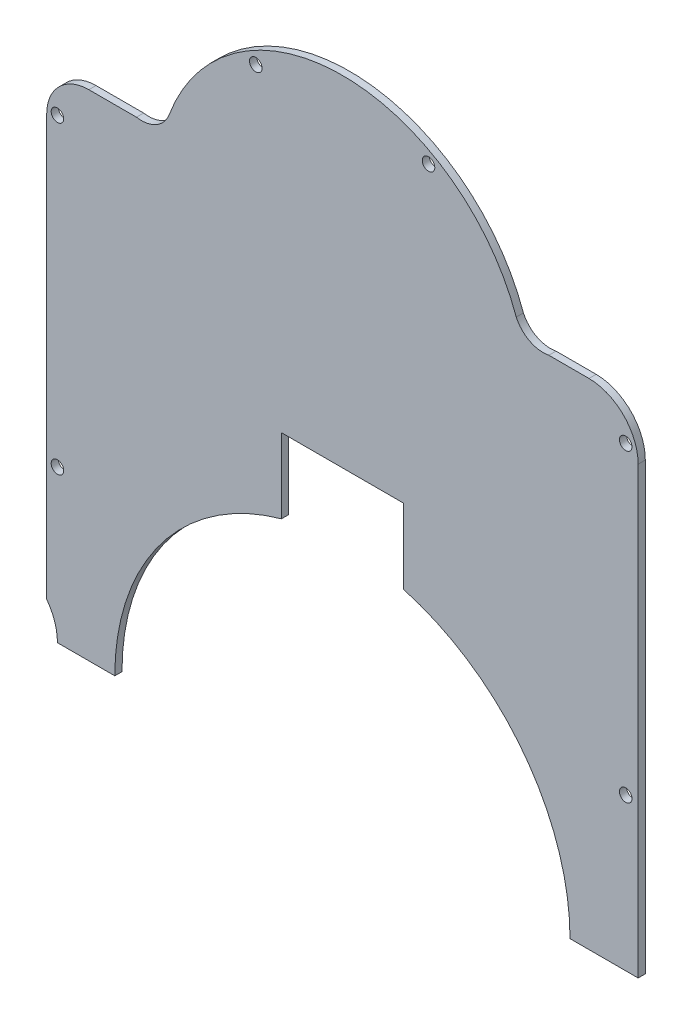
ISO-10303-21;
HEADER;
FILE_DESCRIPTION(('STEP AP214'),'2;1');
FILE_NAME('part.step','',(''),(''),'','','');
FILE_SCHEMA(('AUTOMOTIVE_DESIGN { 1 0 10303 214 1 1 1 1 }'));
ENDSEC;
DATA;
#1=APPLICATION_CONTEXT('core data for automotive mechanical design processes');
#2=APPLICATION_PROTOCOL_DEFINITION('international standard','automotive_design',2000,#1);
#3=PRODUCT_CONTEXT('',#1,'mechanical');
#4=PRODUCT('Part','Part','',(#3));
#5=PRODUCT_RELATED_PRODUCT_CATEGORY('part','',(#4));
#6=PRODUCT_DEFINITION_FORMATION('','',#4);
#7=PRODUCT_DEFINITION_CONTEXT('part definition',#1,'design');
#8=PRODUCT_DEFINITION('design','',#6,#7);
#9=PRODUCT_DEFINITION_SHAPE('','',#8);
#10=(LENGTH_UNIT() NAMED_UNIT(*) SI_UNIT(.MILLI.,.METRE.));
#11=(NAMED_UNIT(*) PLANE_ANGLE_UNIT() SI_UNIT($,.RADIAN.));
#12=(NAMED_UNIT(*) SI_UNIT($,.STERADIAN.) SOLID_ANGLE_UNIT());
#13=UNCERTAINTY_MEASURE_WITH_UNIT(LENGTH_MEASURE(1.E-05),#10,'distance_accuracy_value','');
#14=(GEOMETRIC_REPRESENTATION_CONTEXT(3) GLOBAL_UNCERTAINTY_ASSIGNED_CONTEXT((#13)) GLOBAL_UNIT_ASSIGNED_CONTEXT((#10,
#11,#12)) REPRESENTATION_CONTEXT('',''));
#15=CARTESIAN_POINT('',(0.,0.,0.));
#16=DIRECTION('',(0.,0.,1.));
#17=DIRECTION('',(1.,0.,0.));
#18=AXIS2_PLACEMENT_3D('',#15,#16,#17);
#19=CARTESIAN_POINT('',(0.,37.1227716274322,2.));
#20=DIRECTION('',(0.,0.,-1.));
#21=DIRECTION('',(-1.,0.,0.));
#22=AXIS2_PLACEMENT_3D('',#19,#20,#21);
#23=CYLINDRICAL_SURFACE('',#22,51.5077312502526);
#24=CARTESIAN_POINT('',(0.,37.1227716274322,0.));
#25=DIRECTION('',(0.,0.,1.));
#26=DIRECTION('',(1.,0.,0.));
#27=AXIS2_PLACEMENT_3D('',#24,#25,#26);
#28=CIRCLE('',#27,51.5077312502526);
#29=CARTESIAN_POINT('',(48.4961716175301,54.4769560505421,0.));
#30=VERTEX_POINT('',#29);
#31=CARTESIAN_POINT('',(-48.3027385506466,55.0082916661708,0.));
#32=VERTEX_POINT('',#31);
#33=EDGE_CURVE('E155',#30,#32,#28,.T.);
#34=ORIENTED_EDGE('',*,*,#33,.T.);
#35=DIRECTION('',(0.,0.,-1.));
#36=VECTOR('',#35,1.);
#37=CARTESIAN_POINT('',(-48.3027385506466,55.0082916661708,2.));
#38=LINE('',#37,#36);
#39=CARTESIAN_POINT('',(-48.3027385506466,55.0082916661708,2.));
#40=VERTEX_POINT('',#39);
#41=EDGE_CURVE('E11',#40,#32,#38,.T.);
#42=ORIENTED_EDGE('',*,*,#41,.F.);
#43=CARTESIAN_POINT('',(0.,37.1227716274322,2.));
#44=DIRECTION('',(0.,0.,1.));
#45=DIRECTION('',(1.,0.,0.));
#46=AXIS2_PLACEMENT_3D('',#43,#44,#45);
#47=CIRCLE('',#46,51.5077312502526);
#48=CARTESIAN_POINT('',(48.4961716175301,54.4769560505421,2.));
#49=VERTEX_POINT('',#48);
#50=EDGE_CURVE('E205',#49,#40,#47,.T.);
#51=ORIENTED_EDGE('',*,*,#50,.F.);
#52=DIRECTION('',(0.,0.,-1.));
#53=VECTOR('',#52,1.);
#54=CARTESIAN_POINT('',(48.4961716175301,54.4769560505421,2.));
#55=LINE('',#54,#53);
#56=EDGE_CURVE('E168',#49,#30,#55,.T.);
#57=ORIENTED_EDGE('',*,*,#56,.T.);
#58=EDGE_LOOP('',(#34,#42,#51,#57));
#59=FACE_BOUND('',#58,.T.);
#60=ADVANCED_FACE('F33',(#59),#23,.T.);
#61=CARTESIAN_POINT('',(-56.021869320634,57.9072576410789,2.));
#62=DIRECTION('',(0.,0.,-1.));
#63=DIRECTION('',(-1.,0.,0.));
#64=AXIS2_PLACEMENT_3D('',#61,#62,#63);
#65=CYLINDRICAL_SURFACE('',#64,8.24554325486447);
#66=CARTESIAN_POINT('',(-56.021869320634,57.9072576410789,0.));
#67=DIRECTION('',(0.,0.,-1.));
#68=DIRECTION('',(1.,0.,0.));
#69=AXIS2_PLACEMENT_3D('',#66,#67,#68);
#70=CIRCLE('',#69,8.24554325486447);
#71=CARTESIAN_POINT('',(-57.4466473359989,49.7857435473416,0.));
#72=VERTEX_POINT('',#71);
#73=EDGE_CURVE('E151',#32,#72,#70,.T.);
#74=ORIENTED_EDGE('',*,*,#73,.T.);
#75=DIRECTION('',(0.,0.,-1.));
#76=VECTOR('',#75,1.);
#77=CARTESIAN_POINT('',(-57.4466473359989,49.7857435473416,2.));
#78=LINE('',#77,#76);
#79=CARTESIAN_POINT('',(-57.4466473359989,49.7857435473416,2.));
#80=VERTEX_POINT('',#79);
#81=EDGE_CURVE('E40',#80,#72,#78,.T.);
#82=ORIENTED_EDGE('',*,*,#81,.F.);
#83=CARTESIAN_POINT('',(-56.021869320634,57.9072576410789,2.));
#84=DIRECTION('',(0.,0.,-1.));
#85=DIRECTION('',(1.,0.,0.));
#86=AXIS2_PLACEMENT_3D('',#83,#84,#85);
#87=CIRCLE('',#86,8.24554325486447);
#88=EDGE_CURVE('E164',#40,#80,#87,.T.);
#89=ORIENTED_EDGE('',*,*,#88,.F.);
#90=ORIENTED_EDGE('',*,*,#41,.T.);
#91=EDGE_LOOP('',(#74,#82,#89,#90));
#92=FACE_BOUND('',#91,.T.);
#93=ADVANCED_FACE('F163',(#92),#65,.F.);
#94=CARTESIAN_POINT('',(-57.4466473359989,49.7857435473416,2.));
#95=DIRECTION('',(0.,-1.,0.));
#96=DIRECTION('',(0.,0.,-1.));
#97=AXIS2_PLACEMENT_3D('',#94,#95,#96);
#98=PLANE('',#97);
#99=DIRECTION('',(-1.,0.,0.));
#100=VECTOR('',#99,1.);
#101=CARTESIAN_POINT('',(-57.4466473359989,49.7857435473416,0.));
#102=LINE('',#101,#100);
#103=CARTESIAN_POINT('',(-70.7455432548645,49.7857435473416,0.));
#104=VERTEX_POINT('',#103);
#105=EDGE_CURVE('E157',#72,#104,#102,.T.);
#106=ORIENTED_EDGE('',*,*,#105,.T.);
#107=DIRECTION('',(0.,0.,-1.));
#108=VECTOR('',#107,1.);
#109=CARTESIAN_POINT('',(-70.7455432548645,49.7857435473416,2.));
#110=LINE('',#109,#108);
#111=CARTESIAN_POINT('',(-70.7455432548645,49.7857435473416,2.));
#112=VERTEX_POINT('',#111);
#113=EDGE_CURVE('E276',#112,#104,#110,.T.);
#114=ORIENTED_EDGE('',*,*,#113,.F.);
#115=DIRECTION('',(-1.,0.,0.));
#116=VECTOR('',#115,1.);
#117=CARTESIAN_POINT('',(-57.4466473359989,49.7857435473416,2.));
#118=LINE('',#117,#116);
#119=EDGE_CURVE('E208',#80,#112,#118,.T.);
#120=ORIENTED_EDGE('',*,*,#119,.F.);
#121=ORIENTED_EDGE('',*,*,#81,.T.);
#122=EDGE_LOOP('',(#106,#114,#120,#121));
#123=FACE_BOUND('',#122,.T.);
#124=ADVANCED_FACE('F280',(#123),#98,.F.);
#125=CARTESIAN_POINT('',(-70.7455432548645,38.0312868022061,2.));
#126=DIRECTION('',(0.,0.,-1.));
#127=DIRECTION('',(-1.,0.,0.));
#128=AXIS2_PLACEMENT_3D('',#125,#126,#127);
#129=CYLINDRICAL_SURFACE('',#128,11.7544567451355);
#130=CARTESIAN_POINT('',(-70.7455432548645,38.0312868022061,0.));
#131=DIRECTION('',(0.,0.,1.));
#132=DIRECTION('',(1.,0.,0.));
#133=AXIS2_PLACEMENT_3D('',#130,#131,#132);
#134=CIRCLE('',#133,11.7544567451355);
#135=CARTESIAN_POINT('',(-82.5,38.0312868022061,0.));
#136=VERTEX_POINT('',#135);
#137=EDGE_CURVE('E177',#104,#136,#134,.T.);
#138=ORIENTED_EDGE('',*,*,#137,.T.);
#139=DIRECTION('',(0.,0.,-1.));
#140=VECTOR('',#139,1.);
#141=CARTESIAN_POINT('',(-82.5,38.0312868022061,2.));
#142=LINE('',#141,#140);
#143=CARTESIAN_POINT('',(-82.5,38.0312868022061,2.));
#144=VERTEX_POINT('',#143);
#145=EDGE_CURVE('E273',#144,#136,#142,.T.);
#146=ORIENTED_EDGE('',*,*,#145,.F.);
#147=CARTESIAN_POINT('',(-70.7455432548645,38.0312868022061,2.));
#148=DIRECTION('',(0.,0.,1.));
#149=DIRECTION('',(1.,0.,0.));
#150=AXIS2_PLACEMENT_3D('',#147,#148,#149);
#151=CIRCLE('',#150,11.7544567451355);
#152=EDGE_CURVE('E210',#112,#144,#151,.T.);
#153=ORIENTED_EDGE('',*,*,#152,.F.);
#154=ORIENTED_EDGE('',*,*,#113,.T.);
#155=EDGE_LOOP('',(#138,#146,#153,#154));
#156=FACE_BOUND('',#155,.T.);
#157=ADVANCED_FACE('F288',(#156),#129,.T.);
#158=CARTESIAN_POINT('',(-82.5,38.0312868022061,2.));
#159=DIRECTION('',(1.,0.,0.));
#160=DIRECTION('',(0.,1.,0.));
#161=AXIS2_PLACEMENT_3D('',#158,#159,#160);
#162=PLANE('',#161);
#163=DIRECTION('',(0.,-1.,0.));
#164=VECTOR('',#163,1.);
#165=CARTESIAN_POINT('',(-82.5,38.0312868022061,0.));
#166=LINE('',#165,#164);
#167=CARTESIAN_POINT('',(-82.5,-79.2142564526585,0.));
#168=VERTEX_POINT('',#167);
#169=EDGE_CURVE('E179',#136,#168,#166,.T.);
#170=ORIENTED_EDGE('',*,*,#169,.T.);
#171=DIRECTION('',(0.,0.,-1.));
#172=VECTOR('',#171,1.);
#173=CARTESIAN_POINT('',(-82.5,-79.2142564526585,2.));
#174=LINE('',#173,#172);
#175=CARTESIAN_POINT('',(-82.5,-79.2142564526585,2.));
#176=VERTEX_POINT('',#175);
#177=EDGE_CURVE('E270',#176,#168,#174,.T.);
#178=ORIENTED_EDGE('',*,*,#177,.F.);
#179=DIRECTION('',(0.,-1.,0.));
#180=VECTOR('',#179,1.);
#181=CARTESIAN_POINT('',(-82.5,38.0312868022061,2.));
#182=LINE('',#181,#180);
#183=EDGE_CURVE('E212',#144,#176,#182,.T.);
#184=ORIENTED_EDGE('',*,*,#183,.F.);
#185=ORIENTED_EDGE('',*,*,#145,.T.);
#186=EDGE_LOOP('',(#170,#178,#184,#185));
#187=FACE_BOUND('',#186,.T.);
#188=ADVANCED_FACE('F291',(#187),#162,.F.);
#189=CARTESIAN_POINT('',(-94.5,-88.2142564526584,2.));
#190=DIRECTION('',(0.,0.,-1.));
#191=DIRECTION('',(-1.,0.,0.));
#192=AXIS2_PLACEMENT_3D('',#189,#190,#191);
#193=CYLINDRICAL_SURFACE('',#192,15.);
#194=CARTESIAN_POINT('',(-94.5,-88.2142564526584,0.));
#195=DIRECTION('',(0.,0.,-1.));
#196=DIRECTION('',(1.,0.,0.));
#197=AXIS2_PLACEMENT_3D('',#194,#195,#196);
#198=CIRCLE('',#197,15.);
#199=CARTESIAN_POINT('',(-79.5,-88.2142564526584,0.));
#200=VERTEX_POINT('',#199);
#201=EDGE_CURVE('E181',#168,#200,#198,.T.);
#202=ORIENTED_EDGE('',*,*,#201,.T.);
#203=DIRECTION('',(0.,0.,-1.));
#204=VECTOR('',#203,1.);
#205=CARTESIAN_POINT('',(-79.5,-88.2142564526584,2.));
#206=LINE('',#205,#204);
#207=CARTESIAN_POINT('',(-79.5,-88.2142564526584,2.));
#208=VERTEX_POINT('',#207);
#209=EDGE_CURVE('E267',#208,#200,#206,.T.);
#210=ORIENTED_EDGE('',*,*,#209,.F.);
#211=CARTESIAN_POINT('',(-94.5,-88.2142564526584,2.));
#212=DIRECTION('',(0.,0.,-1.));
#213=DIRECTION('',(1.,0.,0.));
#214=AXIS2_PLACEMENT_3D('',#211,#212,#213);
#215=CIRCLE('',#214,15.);
#216=EDGE_CURVE('E214',#176,#208,#215,.T.);
#217=ORIENTED_EDGE('',*,*,#216,.F.);
#218=ORIENTED_EDGE('',*,*,#177,.T.);
#219=EDGE_LOOP('',(#202,#210,#217,#218));
#220=FACE_BOUND('',#219,.T.);
#221=ADVANCED_FACE('F296',(#220),#193,.F.);
#222=CARTESIAN_POINT('',(-79.5,-88.2142564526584,2.));
#223=DIRECTION('',(0.,1.,0.));
#224=DIRECTION('',(-1.,0.,0.));
#225=AXIS2_PLACEMENT_3D('',#222,#223,#224);
#226=PLANE('',#225);
#227=DIRECTION('',(1.,0.,0.));
#228=VECTOR('',#227,1.);
#229=CARTESIAN_POINT('',(-79.5,-88.2142564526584,0.));
#230=LINE('',#229,#228);
#231=CARTESIAN_POINT('',(-63.5,-88.2142564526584,0.));
#232=VERTEX_POINT('',#231);
#233=EDGE_CURVE('E183',#200,#232,#230,.T.);
#234=ORIENTED_EDGE('',*,*,#233,.T.);
#235=DIRECTION('',(0.,0.,-1.));
#236=VECTOR('',#235,1.);
#237=CARTESIAN_POINT('',(-63.5,-88.2142564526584,2.));
#238=LINE('',#237,#236);
#239=CARTESIAN_POINT('',(-63.5,-88.2142564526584,2.));
#240=VERTEX_POINT('',#239);
#241=EDGE_CURVE('E264',#240,#232,#238,.T.);
#242=ORIENTED_EDGE('',*,*,#241,.F.);
#243=DIRECTION('',(1.,0.,0.));
#244=VECTOR('',#243,1.);
#245=CARTESIAN_POINT('',(-79.5,-88.2142564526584,2.));
#246=LINE('',#245,#244);
#247=EDGE_CURVE('E216',#208,#240,#246,.T.);
#248=ORIENTED_EDGE('',*,*,#247,.F.);
#249=ORIENTED_EDGE('',*,*,#209,.T.);
#250=EDGE_LOOP('',(#234,#242,#248,#249));
#251=FACE_BOUND('',#250,.T.);
#252=ADVANCED_FACE('F302',(#251),#226,.F.);
#253=CARTESIAN_POINT('',(0.,-88.2142564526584,2.));
#254=DIRECTION('',(0.,0.,-1.));
#255=DIRECTION('',(-1.,0.,0.));
#256=AXIS2_PLACEMENT_3D('',#253,#254,#255);
#257=CYLINDRICAL_SURFACE('',#256,63.5);
#258=CARTESIAN_POINT('',(0.,-88.2142564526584,0.));
#259=DIRECTION('',(0.,0.,-1.));
#260=DIRECTION('',(-1.,0.,0.));
#261=AXIS2_PLACEMENT_3D('',#258,#259,#260);
#262=CIRCLE('',#261,63.5);
#263=CARTESIAN_POINT('',(-17.,-27.0321512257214,0.));
#264=VERTEX_POINT('',#263);
#265=EDGE_CURVE('E185',#232,#264,#262,.T.);
#266=ORIENTED_EDGE('',*,*,#265,.T.);
#267=DIRECTION('',(0.,0.,-1.));
#268=VECTOR('',#267,1.);
#269=CARTESIAN_POINT('',(-17.,-27.0321512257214,2.));
#270=LINE('',#269,#268);
#271=CARTESIAN_POINT('',(-17.,-27.0321512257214,2.));
#272=VERTEX_POINT('',#271);
#273=EDGE_CURVE('E261',#272,#264,#270,.T.);
#274=ORIENTED_EDGE('',*,*,#273,.F.);
#275=CARTESIAN_POINT('',(0.,-88.2142564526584,2.));
#276=DIRECTION('',(0.,0.,-1.));
#277=DIRECTION('',(-1.,0.,0.));
#278=AXIS2_PLACEMENT_3D('',#275,#276,#277);
#279=CIRCLE('',#278,63.5);
#280=EDGE_CURVE('E218',#240,#272,#279,.T.);
#281=ORIENTED_EDGE('',*,*,#280,.F.);
#282=ORIENTED_EDGE('',*,*,#241,.T.);
#283=EDGE_LOOP('',(#266,#274,#281,#282));
#284=FACE_BOUND('',#283,.T.);
#285=ADVANCED_FACE('F306',(#284),#257,.F.);
#286=CARTESIAN_POINT('',(-17.,-27.0321512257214,2.));
#287=DIRECTION('',(-1.,0.,0.));
#288=DIRECTION('',(0.,0.,1.));
#289=AXIS2_PLACEMENT_3D('',#286,#287,#288);
#290=PLANE('',#289);
#291=DIRECTION('',(0.,1.,0.));
#292=VECTOR('',#291,1.);
#293=CARTESIAN_POINT('',(-17.,-27.0321512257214,0.));
#294=LINE('',#293,#292);
#295=CARTESIAN_POINT('',(-17.,-6.21425645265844,0.));
#296=VERTEX_POINT('',#295);
#297=EDGE_CURVE('E187',#264,#296,#294,.T.);
#298=ORIENTED_EDGE('',*,*,#297,.T.);
#299=DIRECTION('',(0.,0.,-1.));
#300=VECTOR('',#299,1.);
#301=CARTESIAN_POINT('',(-17.,-6.21425645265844,2.));
#302=LINE('',#301,#300);
#303=CARTESIAN_POINT('',(-17.,-6.21425645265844,2.));
#304=VERTEX_POINT('',#303);
#305=EDGE_CURVE('E258',#304,#296,#302,.T.);
#306=ORIENTED_EDGE('',*,*,#305,.F.);
#307=DIRECTION('',(0.,1.,0.));
#308=VECTOR('',#307,1.);
#309=CARTESIAN_POINT('',(-17.,-27.0321512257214,2.));
#310=LINE('',#309,#308);
#311=EDGE_CURVE('E220',#272,#304,#310,.T.);
#312=ORIENTED_EDGE('',*,*,#311,.F.);
#313=ORIENTED_EDGE('',*,*,#273,.T.);
#314=EDGE_LOOP('',(#298,#306,#312,#313));
#315=FACE_BOUND('',#314,.T.);
#316=ADVANCED_FACE('F311',(#315),#290,.F.);
#317=CARTESIAN_POINT('',(-17.,-6.21425645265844,2.));
#318=DIRECTION('',(0.,1.,0.));
#319=DIRECTION('',(0.,0.,1.));
#320=AXIS2_PLACEMENT_3D('',#317,#318,#319);
#321=PLANE('',#320);
#322=DIRECTION('',(1.,0.,0.));
#323=VECTOR('',#322,1.);
#324=CARTESIAN_POINT('',(-17.,-6.21425645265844,0.));
#325=LINE('',#324,#323);
#326=CARTESIAN_POINT('',(17.,-6.21425645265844,0.));
#327=VERTEX_POINT('',#326);
#328=EDGE_CURVE('E189',#296,#327,#325,.T.);
#329=ORIENTED_EDGE('',*,*,#328,.T.);
#330=DIRECTION('',(0.,0.,-1.));
#331=VECTOR('',#330,1.);
#332=CARTESIAN_POINT('',(17.,-6.21425645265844,2.));
#333=LINE('',#332,#331);
#334=CARTESIAN_POINT('',(17.,-6.21425645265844,2.));
#335=VERTEX_POINT('',#334);
#336=EDGE_CURVE('E255',#335,#327,#333,.T.);
#337=ORIENTED_EDGE('',*,*,#336,.F.);
#338=DIRECTION('',(1.,0.,0.));
#339=VECTOR('',#338,1.);
#340=CARTESIAN_POINT('',(-17.,-6.21425645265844,2.));
#341=LINE('',#340,#339);
#342=EDGE_CURVE('E222',#304,#335,#341,.T.);
#343=ORIENTED_EDGE('',*,*,#342,.F.);
#344=ORIENTED_EDGE('',*,*,#305,.T.);
#345=EDGE_LOOP('',(#329,#337,#343,#344));
#346=FACE_BOUND('',#345,.T.);
#347=ADVANCED_FACE('F317',(#346),#321,.F.);
#348=CARTESIAN_POINT('',(17.,-6.21425645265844,2.));
#349=DIRECTION('',(1.,0.,0.));
#350=DIRECTION('',(0.,1.,0.));
#351=AXIS2_PLACEMENT_3D('',#348,#349,#350);
#352=PLANE('',#351);
#353=DIRECTION('',(0.,-1.,0.));
#354=VECTOR('',#353,1.);
#355=CARTESIAN_POINT('',(17.,-6.21425645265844,0.));
#356=LINE('',#355,#354);
#357=CARTESIAN_POINT('',(17.,-27.0321512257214,0.));
#358=VERTEX_POINT('',#357);
#359=EDGE_CURVE('E191',#327,#358,#356,.T.);
#360=ORIENTED_EDGE('',*,*,#359,.T.);
#361=DIRECTION('',(0.,0.,-1.));
#362=VECTOR('',#361,1.);
#363=CARTESIAN_POINT('',(17.,-27.0321512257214,2.));
#364=LINE('',#363,#362);
#365=CARTESIAN_POINT('',(17.,-27.0321512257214,2.));
#366=VERTEX_POINT('',#365);
#367=EDGE_CURVE('E252',#366,#358,#364,.T.);
#368=ORIENTED_EDGE('',*,*,#367,.F.);
#369=DIRECTION('',(0.,-1.,0.));
#370=VECTOR('',#369,1.);
#371=CARTESIAN_POINT('',(17.,-6.21425645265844,2.));
#372=LINE('',#371,#370);
#373=EDGE_CURVE('E224',#335,#366,#372,.T.);
#374=ORIENTED_EDGE('',*,*,#373,.F.);
#375=ORIENTED_EDGE('',*,*,#336,.T.);
#376=EDGE_LOOP('',(#360,#368,#374,#375));
#377=FACE_BOUND('',#376,.T.);
#378=ADVANCED_FACE('F321',(#377),#352,.F.);
#379=CARTESIAN_POINT('',(0.,-88.2142564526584,2.));
#380=DIRECTION('',(0.,0.,-1.));
#381=DIRECTION('',(-1.,0.,0.));
#382=AXIS2_PLACEMENT_3D('',#379,#380,#381);
#383=CYLINDRICAL_SURFACE('',#382,63.5);
#384=CARTESIAN_POINT('',(0.,-88.2142564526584,0.));
#385=DIRECTION('',(0.,0.,-1.));
#386=DIRECTION('',(-1.,0.,0.));
#387=AXIS2_PLACEMENT_3D('',#384,#385,#386);
#388=CIRCLE('',#387,63.5);
#389=CARTESIAN_POINT('',(63.5,-88.2142564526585,0.));
#390=VERTEX_POINT('',#389);
#391=EDGE_CURVE('E193',#358,#390,#388,.T.);
#392=ORIENTED_EDGE('',*,*,#391,.T.);
#393=DIRECTION('',(0.,0.,-1.));
#394=VECTOR('',#393,1.);
#395=CARTESIAN_POINT('',(63.5,-88.2142564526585,2.));
#396=LINE('',#395,#394);
#397=CARTESIAN_POINT('',(63.5,-88.2142564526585,2.));
#398=VERTEX_POINT('',#397);
#399=EDGE_CURVE('E249',#398,#390,#396,.T.);
#400=ORIENTED_EDGE('',*,*,#399,.F.);
#401=CARTESIAN_POINT('',(0.,-88.2142564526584,2.));
#402=DIRECTION('',(0.,0.,-1.));
#403=DIRECTION('',(-1.,0.,0.));
#404=AXIS2_PLACEMENT_3D('',#401,#402,#403);
#405=CIRCLE('',#404,63.5);
#406=EDGE_CURVE('E226',#366,#398,#405,.T.);
#407=ORIENTED_EDGE('',*,*,#406,.F.);
#408=ORIENTED_EDGE('',*,*,#367,.T.);
#409=EDGE_LOOP('',(#392,#400,#407,#408));
#410=FACE_BOUND('',#409,.T.);
#411=ADVANCED_FACE('F326',(#410),#383,.F.);
#412=CARTESIAN_POINT('',(82.5,-88.2142564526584,2.));
#413=DIRECTION('',(0.,1.,0.));
#414=DIRECTION('',(-1.,0.,0.));
#415=AXIS2_PLACEMENT_3D('',#412,#413,#414);
#416=PLANE('',#415);
#417=DIRECTION('',(1.,0.,0.));
#418=VECTOR('',#417,1.);
#419=CARTESIAN_POINT('',(82.5,-88.2142564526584,0.));
#420=LINE('',#419,#418);
#421=CARTESIAN_POINT('',(82.5,-88.2142564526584,0.));
#422=VERTEX_POINT('',#421);
#423=EDGE_CURVE('E195',#390,#422,#420,.T.);
#424=ORIENTED_EDGE('',*,*,#423,.T.);
#425=DIRECTION('',(0.,0.,-1.));
#426=VECTOR('',#425,1.);
#427=CARTESIAN_POINT('',(82.5,-88.2142564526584,2.));
#428=LINE('',#427,#426);
#429=CARTESIAN_POINT('',(82.5,-88.2142564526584,2.));
#430=VERTEX_POINT('',#429);
#431=EDGE_CURVE('E246',#430,#422,#428,.T.);
#432=ORIENTED_EDGE('',*,*,#431,.F.);
#433=DIRECTION('',(1.,0.,0.));
#434=VECTOR('',#433,1.);
#435=CARTESIAN_POINT('',(82.5,-88.2142564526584,2.));
#436=LINE('',#435,#434);
#437=EDGE_CURVE('E228',#398,#430,#436,.T.);
#438=ORIENTED_EDGE('',*,*,#437,.F.);
#439=ORIENTED_EDGE('',*,*,#399,.T.);
#440=EDGE_LOOP('',(#424,#432,#438,#439));
#441=FACE_BOUND('',#440,.T.);
#442=ADVANCED_FACE('F332',(#441),#416,.F.);
#443=CARTESIAN_POINT('',(82.5,-88.2142564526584,2.));
#444=DIRECTION('',(-1.,0.,0.));
#445=DIRECTION('',(0.,0.,1.));
#446=AXIS2_PLACEMENT_3D('',#443,#444,#445);
#447=PLANE('',#446);
#448=DIRECTION('',(0.,1.,0.));
#449=VECTOR('',#448,1.);
#450=CARTESIAN_POINT('',(82.5,-88.2142564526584,0.));
#451=LINE('',#450,#449);
#452=CARTESIAN_POINT('',(82.5,35.9208109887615,0.));
#453=VERTEX_POINT('',#452);
#454=EDGE_CURVE('E197',#422,#453,#451,.T.);
#455=ORIENTED_EDGE('',*,*,#454,.T.);
#456=DIRECTION('',(0.,0.,-1.));
#457=VECTOR('',#456,1.);
#458=CARTESIAN_POINT('',(82.5,35.9208109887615,2.));
#459=LINE('',#458,#457);
#460=CARTESIAN_POINT('',(82.5,35.9208109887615,2.));
#461=VERTEX_POINT('',#460);
#462=EDGE_CURVE('E243',#461,#453,#459,.T.);
#463=ORIENTED_EDGE('',*,*,#462,.F.);
#464=DIRECTION('',(0.,1.,0.));
#465=VECTOR('',#464,1.);
#466=CARTESIAN_POINT('',(82.5,-88.2142564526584,2.));
#467=LINE('',#466,#465);
#468=EDGE_CURVE('E230',#430,#461,#467,.T.);
#469=ORIENTED_EDGE('',*,*,#468,.F.);
#470=ORIENTED_EDGE('',*,*,#431,.T.);
#471=EDGE_LOOP('',(#455,#463,#469,#470));
#472=FACE_BOUND('',#471,.T.);
#473=ADVANCED_FACE('F336',(#472),#447,.F.);
#474=CARTESIAN_POINT('',(68.6342239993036,35.9208109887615,2.));
#475=DIRECTION('',(0.,0.,-1.));
#476=DIRECTION('',(-1.,0.,0.));
#477=AXIS2_PLACEMENT_3D('',#474,#475,#476);
#478=CYLINDRICAL_SURFACE('',#477,13.8657760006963);
#479=CARTESIAN_POINT('',(68.6342239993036,35.9208109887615,0.));
#480=DIRECTION('',(0.,0.,1.));
#481=DIRECTION('',(1.,0.,0.));
#482=AXIS2_PLACEMENT_3D('',#479,#480,#481);
#483=CIRCLE('',#482,13.8657760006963);
#484=CARTESIAN_POINT('',(68.7871594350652,49.7857435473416,0.));
#485=VERTEX_POINT('',#484);
#486=EDGE_CURVE('E199',#453,#485,#483,.T.);
#487=ORIENTED_EDGE('',*,*,#486,.T.);
#488=DIRECTION('',(0.,0.,-1.));
#489=VECTOR('',#488,1.);
#490=CARTESIAN_POINT('',(68.7871594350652,49.7857435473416,2.));
#491=LINE('',#490,#489);
#492=CARTESIAN_POINT('',(68.7871594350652,49.7857435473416,2.));
#493=VERTEX_POINT('',#492);
#494=EDGE_CURVE('E240',#493,#485,#491,.T.);
#495=ORIENTED_EDGE('',*,*,#494,.F.);
#496=CARTESIAN_POINT('',(68.6342239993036,35.9208109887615,2.));
#497=DIRECTION('',(0.,0.,1.));
#498=DIRECTION('',(1.,0.,0.));
#499=AXIS2_PLACEMENT_3D('',#496,#497,#498);
#500=CIRCLE('',#499,13.8657760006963);
#501=EDGE_CURVE('E232',#461,#493,#500,.T.);
#502=ORIENTED_EDGE('',*,*,#501,.F.);
#503=ORIENTED_EDGE('',*,*,#462,.T.);
#504=EDGE_LOOP('',(#487,#495,#502,#503));
#505=FACE_BOUND('',#504,.T.);
#506=ADVANCED_FACE('F341',(#505),#478,.T.);
#507=CARTESIAN_POINT('',(68.7871594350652,49.7857435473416,2.));
#508=DIRECTION('',(0.,-1.,0.));
#509=DIRECTION('',(0.,0.,-1.));
#510=AXIS2_PLACEMENT_3D('',#507,#508,#509);
#511=PLANE('',#510);
#512=DIRECTION('',(-1.,0.,0.));
#513=VECTOR('',#512,1.);
#514=CARTESIAN_POINT('',(68.7871594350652,49.7857435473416,0.));
#515=LINE('',#514,#513);
#516=CARTESIAN_POINT('',(57.5809147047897,49.7857435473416,0.));
#517=VERTEX_POINT('',#516);
#518=EDGE_CURVE('E201',#485,#517,#515,.T.);
#519=ORIENTED_EDGE('',*,*,#518,.T.);
#520=DIRECTION('',(0.,0.,-1.));
#521=VECTOR('',#520,1.);
#522=CARTESIAN_POINT('',(57.5809147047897,49.7857435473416,2.));
#523=LINE('',#522,#521);
#524=CARTESIAN_POINT('',(57.5809147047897,49.7857435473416,2.));
#525=VERTEX_POINT('',#524);
#526=EDGE_CURVE('E237',#525,#517,#523,.T.);
#527=ORIENTED_EDGE('',*,*,#526,.F.);
#528=DIRECTION('',(-1.,0.,0.));
#529=VECTOR('',#528,1.);
#530=CARTESIAN_POINT('',(68.7871594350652,49.7857435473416,2.));
#531=LINE('',#530,#529);
#532=EDGE_CURVE('E52',#493,#525,#531,.T.);
#533=ORIENTED_EDGE('',*,*,#532,.F.);
#534=ORIENTED_EDGE('',*,*,#494,.T.);
#535=EDGE_LOOP('',(#519,#527,#533,#534));
#536=FACE_BOUND('',#535,.T.);
#537=ADVANCED_FACE('F344',(#536),#511,.F.);
#538=CARTESIAN_POINT('',(56.0068729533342,57.8796533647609,2.));
#539=DIRECTION('',(0.,0.,-1.));
#540=DIRECTION('',(-1.,0.,0.));
#541=AXIS2_PLACEMENT_3D('',#538,#539,#540);
#542=CYLINDRICAL_SURFACE('',#541,8.24554325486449);
#543=CARTESIAN_POINT('',(56.0068729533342,57.8796533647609,0.));
#544=DIRECTION('',(0.,0.,-1.));
#545=DIRECTION('',(1.,0.,0.));
#546=AXIS2_PLACEMENT_3D('',#543,#544,#545);
#547=CIRCLE('',#546,8.24554325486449);
#548=EDGE_CURVE('E203',#517,#30,#547,.T.);
#549=ORIENTED_EDGE('',*,*,#548,.T.);
#550=ORIENTED_EDGE('',*,*,#56,.F.);
#551=CARTESIAN_POINT('',(56.0068729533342,57.8796533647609,2.));
#552=DIRECTION('',(0.,0.,-1.));
#553=DIRECTION('',(1.,0.,0.));
#554=AXIS2_PLACEMENT_3D('',#551,#552,#553);
#555=CIRCLE('',#554,8.24554325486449);
#556=EDGE_CURVE('E47',#525,#49,#555,.T.);
#557=ORIENTED_EDGE('',*,*,#556,.F.);
#558=ORIENTED_EDGE('',*,*,#526,.T.);
#559=EDGE_LOOP('',(#549,#550,#557,#558));
#560=FACE_BOUND('',#559,.T.);
#561=ADVANCED_FACE('F346',(#560),#542,.F.);
#562=CARTESIAN_POINT('',(0.,37.1227716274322,2.));
#563=DIRECTION('',(0.,0.,1.));
#564=DIRECTION('',(1.,0.,0.));
#565=AXIS2_PLACEMENT_3D('',#562,#563,#564);
#566=PLANE('',#565);
#567=CARTESIAN_POINT('',(79.0358983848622,39.2386586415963,2.));
#568=DIRECTION('',(0.,0.,1.));
#569=DIRECTION('',(1.,0.,0.));
#570=AXIS2_PLACEMENT_3D('',#567,#568,#569);
#571=CIRCLE('',#570,1.74999999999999);
#572=CARTESIAN_POINT('',(80.7858983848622,39.2386586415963,2.));
#573=VERTEX_POINT('',#572);
#574=EDGE_CURVE('E485',#573,#573,#571,.T.);
#575=ORIENTED_EDGE('',*,*,#574,.F.);
#576=EDGE_LOOP('',(#575));
#577=FACE_BOUND('',#576,.T.);
#578=CARTESIAN_POINT('',(79.0358983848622,-45.7613413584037,1.99999999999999));
#579=DIRECTION('',(0.,0.,1.));
#580=DIRECTION('',(1.,0.,0.));
#581=AXIS2_PLACEMENT_3D('',#578,#579,#580);
#582=CIRCLE('',#581,1.74999999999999);
#583=CARTESIAN_POINT('',(80.7858983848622,-45.7613413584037,1.99999999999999));
#584=VERTEX_POINT('',#583);
#585=EDGE_CURVE('E489',#584,#584,#582,.T.);
#586=ORIENTED_EDGE('',*,*,#585,.F.);
#587=EDGE_LOOP('',(#586));
#588=FACE_BOUND('',#587,.T.);
#589=CARTESIAN_POINT('',(24.019297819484,79.2098638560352,2.));
#590=DIRECTION('',(0.,0.,1.));
#591=DIRECTION('',(1.,0.,0.));
#592=AXIS2_PLACEMENT_3D('',#589,#590,#591);
#593=CIRCLE('',#592,1.74999999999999);
#594=CARTESIAN_POINT('',(25.769297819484,79.2098638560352,2.));
#595=VERTEX_POINT('',#594);
#596=EDGE_CURVE('E498',#595,#595,#593,.T.);
#597=ORIENTED_EDGE('',*,*,#596,.F.);
#598=EDGE_LOOP('',(#597));
#599=FACE_BOUND('',#598,.T.);
#600=CARTESIAN_POINT('',(-24.1673850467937,79.1250037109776,2.));
#601=DIRECTION('',(0.,0.,1.));
#602=DIRECTION('',(1.,0.,0.));
#603=AXIS2_PLACEMENT_3D('',#600,#601,#602);
#604=CIRCLE('',#603,1.74999999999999);
#605=CARTESIAN_POINT('',(-22.4173850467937,79.1250037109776,2.));
#606=VERTEX_POINT('',#605);
#607=EDGE_CURVE('E501',#606,#606,#604,.T.);
#608=ORIENTED_EDGE('',*,*,#607,.F.);
#609=EDGE_LOOP('',(#608));
#610=FACE_BOUND('',#609,.T.);
#611=CARTESIAN_POINT('',(-79.5,39.2386586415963,2.));
#612=DIRECTION('',(0.,0.,1.));
#613=DIRECTION('',(1.,0.,0.));
#614=AXIS2_PLACEMENT_3D('',#611,#612,#613);
#615=CIRCLE('',#614,1.74999999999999);
#616=CARTESIAN_POINT('',(-77.75,39.2386586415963,2.));
#617=VERTEX_POINT('',#616);
#618=EDGE_CURVE('E507',#617,#617,#615,.T.);
#619=ORIENTED_EDGE('',*,*,#618,.F.);
#620=EDGE_LOOP('',(#619));
#621=FACE_BOUND('',#620,.T.);
#622=CARTESIAN_POINT('',(-79.5,-45.7613413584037,2.));
#623=DIRECTION('',(0.,0.,1.));
#624=DIRECTION('',(1.,0.,0.));
#625=AXIS2_PLACEMENT_3D('',#622,#623,#624);
#626=CIRCLE('',#625,1.74999999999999);
#627=CARTESIAN_POINT('',(-77.75,-45.7613413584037,2.));
#628=VERTEX_POINT('',#627);
#629=EDGE_CURVE('E172',#628,#628,#626,.T.);
#630=ORIENTED_EDGE('',*,*,#629,.F.);
#631=EDGE_LOOP('',(#630));
#632=FACE_BOUND('',#631,.T.);
#633=ORIENTED_EDGE('',*,*,#50,.T.);
#634=ORIENTED_EDGE('',*,*,#88,.T.);
#635=ORIENTED_EDGE('',*,*,#119,.T.);
#636=ORIENTED_EDGE('',*,*,#152,.T.);
#637=ORIENTED_EDGE('',*,*,#183,.T.);
#638=ORIENTED_EDGE('',*,*,#216,.T.);
#639=ORIENTED_EDGE('',*,*,#247,.T.);
#640=ORIENTED_EDGE('',*,*,#280,.T.);
#641=ORIENTED_EDGE('',*,*,#311,.T.);
#642=ORIENTED_EDGE('',*,*,#342,.T.);
#643=ORIENTED_EDGE('',*,*,#373,.T.);
#644=ORIENTED_EDGE('',*,*,#406,.T.);
#645=ORIENTED_EDGE('',*,*,#437,.T.);
#646=ORIENTED_EDGE('',*,*,#468,.T.);
#647=ORIENTED_EDGE('',*,*,#501,.T.);
#648=ORIENTED_EDGE('',*,*,#532,.T.);
#649=ORIENTED_EDGE('',*,*,#556,.T.);
#650=EDGE_LOOP('',(#633,#634,#635,#636,#637,#638,#639,#640,#641,#642,#643,#644,#645,#646,#647,
#648,#649));
#651=FACE_BOUND('',#650,.T.);
#652=ADVANCED_FACE('F283',(#577,#588,#599,#610,#621,#632,#651),#566,.T.);
#653=CARTESIAN_POINT('',(0.,37.1227716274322,0.));
#654=DIRECTION('',(0.,0.,1.));
#655=DIRECTION('',(1.,0.,0.));
#656=AXIS2_PLACEMENT_3D('',#653,#654,#655);
#657=PLANE('',#656);
#658=CARTESIAN_POINT('',(79.0358983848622,39.2386586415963,0.));
#659=DIRECTION('',(0.,0.,1.));
#660=DIRECTION('',(1.,0.,0.));
#661=AXIS2_PLACEMENT_3D('',#658,#659,#660);
#662=CIRCLE('',#661,1.74999999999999);
#663=CARTESIAN_POINT('',(80.7858983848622,39.2386586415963,0.));
#664=VERTEX_POINT('',#663);
#665=EDGE_CURVE('E482',#664,#664,#662,.T.);
#666=ORIENTED_EDGE('',*,*,#665,.T.);
#667=EDGE_LOOP('',(#666));
#668=FACE_BOUND('',#667,.T.);
#669=CARTESIAN_POINT('',(79.0358983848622,-45.7613413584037,0.));
#670=DIRECTION('',(0.,0.,1.));
#671=DIRECTION('',(1.,0.,0.));
#672=AXIS2_PLACEMENT_3D('',#669,#670,#671);
#673=CIRCLE('',#672,1.74999999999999);
#674=CARTESIAN_POINT('',(80.7858983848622,-45.7613413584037,0.));
#675=VERTEX_POINT('',#674);
#676=EDGE_CURVE('E486',#675,#675,#673,.T.);
#677=ORIENTED_EDGE('',*,*,#676,.T.);
#678=EDGE_LOOP('',(#677));
#679=FACE_BOUND('',#678,.T.);
#680=CARTESIAN_POINT('',(24.019297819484,79.2098638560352,0.));
#681=DIRECTION('',(0.,0.,1.));
#682=DIRECTION('',(1.,0.,0.));
#683=AXIS2_PLACEMENT_3D('',#680,#681,#682);
#684=CIRCLE('',#683,1.74999999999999);
#685=CARTESIAN_POINT('',(25.769297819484,79.2098638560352,0.));
#686=VERTEX_POINT('',#685);
#687=EDGE_CURVE('E495',#686,#686,#684,.T.);
#688=ORIENTED_EDGE('',*,*,#687,.T.);
#689=EDGE_LOOP('',(#688));
#690=FACE_BOUND('',#689,.T.);
#691=CARTESIAN_POINT('',(-24.1673850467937,79.1250037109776,0.));
#692=DIRECTION('',(0.,0.,1.));
#693=DIRECTION('',(1.,0.,0.));
#694=AXIS2_PLACEMENT_3D('',#691,#692,#693);
#695=CIRCLE('',#694,1.75);
#696=CARTESIAN_POINT('',(-22.4173850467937,79.1250037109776,0.));
#697=VERTEX_POINT('',#696);
#698=EDGE_CURVE('E504',#697,#697,#695,.T.);
#699=ORIENTED_EDGE('',*,*,#698,.T.);
#700=EDGE_LOOP('',(#699));
#701=FACE_BOUND('',#700,.T.);
#702=CARTESIAN_POINT('',(-79.5,39.2386586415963,0.));
#703=DIRECTION('',(0.,0.,1.));
#704=DIRECTION('',(1.,0.,0.));
#705=AXIS2_PLACEMENT_3D('',#702,#703,#704);
#706=CIRCLE('',#705,1.75);
#707=CARTESIAN_POINT('',(-77.75,39.2386586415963,0.));
#708=VERTEX_POINT('',#707);
#709=EDGE_CURVE('E510',#708,#708,#706,.T.);
#710=ORIENTED_EDGE('',*,*,#709,.T.);
#711=EDGE_LOOP('',(#710));
#712=FACE_BOUND('',#711,.T.);
#713=CARTESIAN_POINT('',(-79.5,-45.7613413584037,0.));
#714=DIRECTION('',(0.,0.,1.));
#715=DIRECTION('',(1.,0.,0.));
#716=AXIS2_PLACEMENT_3D('',#713,#714,#715);
#717=CIRCLE('',#716,1.75);
#718=CARTESIAN_POINT('',(-77.75,-45.7613413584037,0.));
#719=VERTEX_POINT('',#718);
#720=EDGE_CURVE('E169',#719,#719,#717,.T.);
#721=ORIENTED_EDGE('',*,*,#720,.T.);
#722=EDGE_LOOP('',(#721));
#723=FACE_BOUND('',#722,.T.);
#724=ORIENTED_EDGE('',*,*,#33,.F.);
#725=ORIENTED_EDGE('',*,*,#548,.F.);
#726=ORIENTED_EDGE('',*,*,#518,.F.);
#727=ORIENTED_EDGE('',*,*,#486,.F.);
#728=ORIENTED_EDGE('',*,*,#454,.F.);
#729=ORIENTED_EDGE('',*,*,#423,.F.);
#730=ORIENTED_EDGE('',*,*,#391,.F.);
#731=ORIENTED_EDGE('',*,*,#359,.F.);
#732=ORIENTED_EDGE('',*,*,#328,.F.);
#733=ORIENTED_EDGE('',*,*,#297,.F.);
#734=ORIENTED_EDGE('',*,*,#265,.F.);
#735=ORIENTED_EDGE('',*,*,#233,.F.);
#736=ORIENTED_EDGE('',*,*,#201,.F.);
#737=ORIENTED_EDGE('',*,*,#169,.F.);
#738=ORIENTED_EDGE('',*,*,#137,.F.);
#739=ORIENTED_EDGE('',*,*,#105,.F.);
#740=ORIENTED_EDGE('',*,*,#73,.F.);
#741=EDGE_LOOP('',(#724,#725,#726,#727,#728,#729,#730,#731,#732,#733,#734,#735,#736,#737,#738,
#739,#740));
#742=FACE_BOUND('',#741,.T.);
#743=ADVANCED_FACE('F152',(#668,#679,#690,#701,#712,#723,#742),#657,.F.);
#744=CARTESIAN_POINT('',(-79.5,-45.7613413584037,2.));
#745=DIRECTION('',(0.,0.,1.));
#746=DIRECTION('',(1.,0.,0.));
#747=AXIS2_PLACEMENT_3D('',#744,#745,#746);
#748=CYLINDRICAL_SURFACE('',#747,1.74999999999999);
#749=ORIENTED_EDGE('',*,*,#720,.F.);
#750=EDGE_LOOP('',(#749));
#751=FACE_BOUND('',#750,.T.);
#752=ORIENTED_EDGE('',*,*,#629,.T.);
#753=EDGE_LOOP('',(#752));
#754=FACE_BOUND('',#753,.T.);
#755=ADVANCED_FACE('F406',(#751,#754),#748,.F.);
#756=CARTESIAN_POINT('',(-79.5,39.2386586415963,2.));
#757=DIRECTION('',(0.,0.,1.));
#758=DIRECTION('',(1.,0.,0.));
#759=AXIS2_PLACEMENT_3D('',#756,#757,#758);
#760=CYLINDRICAL_SURFACE('',#759,1.74999999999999);
#761=ORIENTED_EDGE('',*,*,#709,.F.);
#762=EDGE_LOOP('',(#761));
#763=FACE_BOUND('',#762,.T.);
#764=ORIENTED_EDGE('',*,*,#618,.T.);
#765=EDGE_LOOP('',(#764));
#766=FACE_BOUND('',#765,.T.);
#767=ADVANCED_FACE('F411',(#763,#766),#760,.F.);
#768=CARTESIAN_POINT('',(-24.1673850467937,79.1250037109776,2.));
#769=DIRECTION('',(0.,0.,1.));
#770=DIRECTION('',(1.,0.,0.));
#771=AXIS2_PLACEMENT_3D('',#768,#769,#770);
#772=CYLINDRICAL_SURFACE('',#771,1.74999999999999);
#773=ORIENTED_EDGE('',*,*,#698,.F.);
#774=EDGE_LOOP('',(#773));
#775=FACE_BOUND('',#774,.T.);
#776=ORIENTED_EDGE('',*,*,#607,.T.);
#777=EDGE_LOOP('',(#776));
#778=FACE_BOUND('',#777,.T.);
#779=ADVANCED_FACE('F423',(#775,#778),#772,.F.);
#780=CARTESIAN_POINT('',(24.019297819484,79.2098638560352,2.));
#781=DIRECTION('',(0.,0.,1.));
#782=DIRECTION('',(1.,0.,0.));
#783=AXIS2_PLACEMENT_3D('',#780,#781,#782);
#784=CYLINDRICAL_SURFACE('',#783,1.74999999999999);
#785=ORIENTED_EDGE('',*,*,#687,.F.);
#786=EDGE_LOOP('',(#785));
#787=FACE_BOUND('',#786,.T.);
#788=ORIENTED_EDGE('',*,*,#596,.T.);
#789=EDGE_LOOP('',(#788));
#790=FACE_BOUND('',#789,.T.);
#791=ADVANCED_FACE('F433',(#787,#790),#784,.F.);
#792=CARTESIAN_POINT('',(79.0358983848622,-45.7613413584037,1.99999999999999));
#793=DIRECTION('',(0.,0.,1.));
#794=DIRECTION('',(1.,0.,0.));
#795=AXIS2_PLACEMENT_3D('',#792,#793,#794);
#796=CYLINDRICAL_SURFACE('',#795,1.74999999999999);
#797=ORIENTED_EDGE('',*,*,#676,.F.);
#798=EDGE_LOOP('',(#797));
#799=FACE_BOUND('',#798,.T.);
#800=ORIENTED_EDGE('',*,*,#585,.T.);
#801=EDGE_LOOP('',(#800));
#802=FACE_BOUND('',#801,.T.);
#803=ADVANCED_FACE('F455',(#799,#802),#796,.F.);
#804=CARTESIAN_POINT('',(79.0358983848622,39.2386586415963,2.));
#805=DIRECTION('',(0.,0.,1.));
#806=DIRECTION('',(1.,0.,0.));
#807=AXIS2_PLACEMENT_3D('',#804,#805,#806);
#808=CYLINDRICAL_SURFACE('',#807,1.74999999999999);
#809=ORIENTED_EDGE('',*,*,#665,.F.);
#810=EDGE_LOOP('',(#809));
#811=FACE_BOUND('',#810,.T.);
#812=ORIENTED_EDGE('',*,*,#574,.T.);
#813=EDGE_LOOP('',(#812));
#814=FACE_BOUND('',#813,.T.);
#815=ADVANCED_FACE('F465',(#811,#814),#808,.F.);
#816=CLOSED_SHELL('',(#60,#93,#124,#157,#188,#221,#252,#285,#316,#347,#378,#411,#442,#473,#506,
#537,#561,#652,#743,#755,#767,#779,#791,#803,#815));
#817=MANIFOLD_SOLID_BREP('B2',#816);
#818=ADVANCED_BREP_SHAPE_REPRESENTATION('',(#18,#817),#14);
#819=SHAPE_DEFINITION_REPRESENTATION(#9,#818);
ENDSEC;
END-ISO-10303-21;
